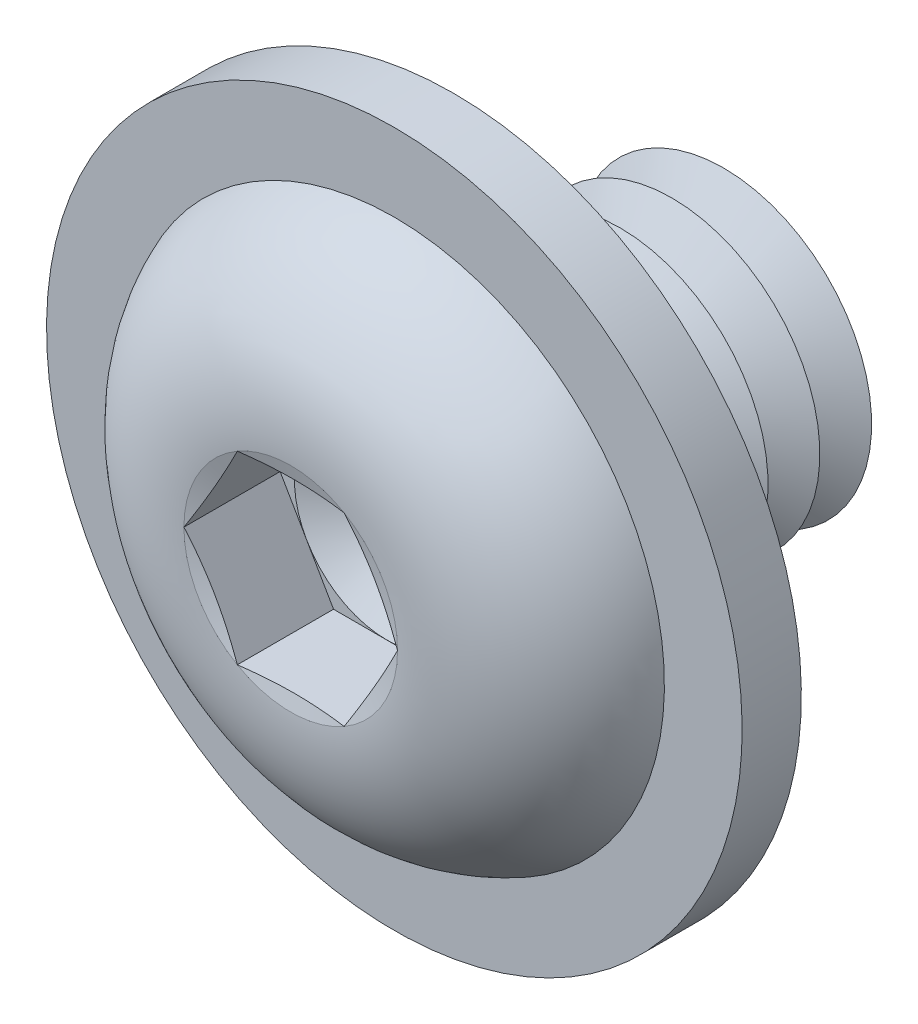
ISO-10303-21;
HEADER;
FILE_DESCRIPTION(('STEP AP214'),'2;1');
FILE_NAME('part.step','',(''),(''),'','','');
FILE_SCHEMA(('AUTOMOTIVE_DESIGN { 1 0 10303 214 1 1 1 1 }'));
ENDSEC;
DATA;
#1=APPLICATION_CONTEXT('core data for automotive mechanical design processes');
#2=APPLICATION_PROTOCOL_DEFINITION('international standard','automotive_design',2000,#1);
#3=PRODUCT_CONTEXT('',#1,'mechanical');
#4=PRODUCT('Part','Part','',(#3));
#5=PRODUCT_RELATED_PRODUCT_CATEGORY('part','',(#4));
#6=PRODUCT_DEFINITION_FORMATION('','',#4);
#7=PRODUCT_DEFINITION_CONTEXT('part definition',#1,'design');
#8=PRODUCT_DEFINITION('design','',#6,#7);
#9=PRODUCT_DEFINITION_SHAPE('','',#8);
#10=(LENGTH_UNIT() NAMED_UNIT(*) SI_UNIT(.MILLI.,.METRE.));
#11=(NAMED_UNIT(*) PLANE_ANGLE_UNIT() SI_UNIT($,.RADIAN.));
#12=(NAMED_UNIT(*) SI_UNIT($,.STERADIAN.) SOLID_ANGLE_UNIT());
#13=UNCERTAINTY_MEASURE_WITH_UNIT(LENGTH_MEASURE(1.E-05),#10,'distance_accuracy_value','');
#14=(GEOMETRIC_REPRESENTATION_CONTEXT(3) GLOBAL_UNCERTAINTY_ASSIGNED_CONTEXT((#13)) GLOBAL_UNIT_ASSIGNED_CONTEXT((#10,
#11,#12)) REPRESENTATION_CONTEXT('',''));
#15=CARTESIAN_POINT('',(0.,0.,0.));
#16=DIRECTION('',(0.,0.,1.));
#17=DIRECTION('',(1.,0.,0.));
#18=AXIS2_PLACEMENT_3D('',#15,#16,#17);
#19=CARTESIAN_POINT('',(0.,0.,-1.55));
#20=DIRECTION('',(0.,0.,1.));
#21=DIRECTION('',(0.,-1.,0.));
#22=AXIS2_PLACEMENT_3D('',#19,#20,#21);
#23=CONICAL_SURFACE('',#22,2.,1.04719755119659);
#24=CARTESIAN_POINT('',(0.,0.,-1.9));
#25=DIRECTION('',(0.,0.,1.));
#26=DIRECTION('',(0.,-1.,0.));
#27=AXIS2_PLACEMENT_3D('',#24,#25,#26);
#28=CIRCLE('',#27,1.39378221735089);
#29=CARTESIAN_POINT('',(0.,-1.39378221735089,-1.90000000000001));
#30=VERTEX_POINT('',#29);
#31=EDGE_CURVE('E249',#30,#30,#28,.T.);
#32=ORIENTED_EDGE('',*,*,#31,.T.);
#33=EDGE_LOOP('',(#32));
#34=FACE_BOUND('',#33,.T.);
#35=CARTESIAN_POINT('',(0.,0.,-1.55));
#36=DIRECTION('',(0.,0.,1.));
#37=DIRECTION('',(0.,-1.,0.));
#38=AXIS2_PLACEMENT_3D('',#35,#36,#37);
#39=CIRCLE('',#38,2.);
#40=CARTESIAN_POINT('',(0.,-2.,-1.55));
#41=VERTEX_POINT('',#40);
#42=EDGE_CURVE('E241',#41,#41,#39,.T.);
#43=ORIENTED_EDGE('',*,*,#42,.F.);
#44=EDGE_LOOP('',(#43));
#45=FACE_BOUND('',#44,.T.);
#46=ADVANCED_FACE('F39',(#34,#45),#23,.T.);
#47=CARTESIAN_POINT('',(0.,0.,-1.9));
#48=DIRECTION('',(0.,0.,-1.));
#49=DIRECTION('',(0.,1.,0.));
#50=AXIS2_PLACEMENT_3D('',#47,#48,#49);
#51=CONICAL_SURFACE('',#50,1.39378221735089,1.0471975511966);
#52=CARTESIAN_POINT('',(0.,0.,-2.25));
#53=DIRECTION('',(0.,0.,1.));
#54=DIRECTION('',(0.,-1.,0.));
#55=AXIS2_PLACEMENT_3D('',#52,#53,#54);
#56=CIRCLE('',#55,2.);
#57=CARTESIAN_POINT('',(0.,-2.,-2.25));
#58=VERTEX_POINT('',#57);
#59=EDGE_CURVE('E253',#58,#58,#56,.T.);
#60=ORIENTED_EDGE('',*,*,#59,.T.);
#61=EDGE_LOOP('',(#60));
#62=FACE_BOUND('',#61,.T.);
#63=ORIENTED_EDGE('',*,*,#31,.F.);
#64=EDGE_LOOP('',(#63));
#65=FACE_BOUND('',#64,.T.);
#66=ADVANCED_FACE('F373',(#62,#65),#51,.T.);
#67=CARTESIAN_POINT('',(0.,1.99999999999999,-4.));
#68=DIRECTION('',(0.,0.,-1.));
#69=DIRECTION('',(0.,1.,0.));
#70=AXIS2_PLACEMENT_3D('',#67,#68,#69);
#71=PLANE('',#70);
#72=CARTESIAN_POINT('',(0.,0.,-4.));
#73=DIRECTION('',(0.,0.,1.));
#74=DIRECTION('',(0.,-1.,0.));
#75=AXIS2_PLACEMENT_3D('',#72,#73,#74);
#76=CIRCLE('',#75,1.39378221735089);
#77=CARTESIAN_POINT('',(0.,-1.39378221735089,-4.00000000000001));
#78=VERTEX_POINT('',#77);
#79=EDGE_CURVE('E273',#78,#78,#76,.T.);
#80=ORIENTED_EDGE('',*,*,#79,.F.);
#81=EDGE_LOOP('',(#80));
#82=FACE_BOUND('',#81,.T.);
#83=ADVANCED_FACE('F379',(#82),#71,.T.);
#84=CARTESIAN_POINT('',(0.,0.,-3.65));
#85=DIRECTION('',(0.,0.,1.));
#86=DIRECTION('',(0.,-1.,0.));
#87=AXIS2_PLACEMENT_3D('',#84,#85,#86);
#88=CONICAL_SURFACE('',#87,2.,1.04719755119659);
#89=ORIENTED_EDGE('',*,*,#79,.T.);
#90=EDGE_LOOP('',(#89));
#91=FACE_BOUND('',#90,.T.);
#92=CARTESIAN_POINT('',(0.,0.,-3.65));
#93=DIRECTION('',(0.,0.,1.));
#94=DIRECTION('',(0.,-1.,0.));
#95=AXIS2_PLACEMENT_3D('',#92,#93,#94);
#96=CIRCLE('',#95,2.);
#97=CARTESIAN_POINT('',(0.,-2.,-3.65));
#98=VERTEX_POINT('',#97);
#99=EDGE_CURVE('E269',#98,#98,#96,.T.);
#100=ORIENTED_EDGE('',*,*,#99,.F.);
#101=EDGE_LOOP('',(#100));
#102=FACE_BOUND('',#101,.T.);
#103=ADVANCED_FACE('F397',(#91,#102),#88,.T.);
#104=CARTESIAN_POINT('',(0.,0.,-3.3));
#105=DIRECTION('',(0.,0.,-1.));
#106=DIRECTION('',(0.,1.,0.));
#107=AXIS2_PLACEMENT_3D('',#104,#105,#106);
#108=CONICAL_SURFACE('',#107,1.39378221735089,1.0471975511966);
#109=ORIENTED_EDGE('',*,*,#99,.T.);
#110=EDGE_LOOP('',(#109));
#111=FACE_BOUND('',#110,.T.);
#112=CARTESIAN_POINT('',(0.,0.,-3.3));
#113=DIRECTION('',(0.,0.,1.));
#114=DIRECTION('',(0.,-1.,0.));
#115=AXIS2_PLACEMENT_3D('',#112,#113,#114);
#116=CIRCLE('',#115,1.39378221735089);
#117=CARTESIAN_POINT('',(0.,-1.39378221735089,-3.30000000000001));
#118=VERTEX_POINT('',#117);
#119=EDGE_CURVE('E265',#118,#118,#116,.T.);
#120=ORIENTED_EDGE('',*,*,#119,.F.);
#121=EDGE_LOOP('',(#120));
#122=FACE_BOUND('',#121,.T.);
#123=ADVANCED_FACE('F394',(#111,#122),#108,.T.);
#124=CARTESIAN_POINT('',(0.,0.,-2.95));
#125=DIRECTION('',(0.,0.,1.));
#126=DIRECTION('',(0.,-1.,0.));
#127=AXIS2_PLACEMENT_3D('',#124,#125,#126);
#128=CONICAL_SURFACE('',#127,2.,1.04719755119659);
#129=ORIENTED_EDGE('',*,*,#119,.T.);
#130=EDGE_LOOP('',(#129));
#131=FACE_BOUND('',#130,.T.);
#132=CARTESIAN_POINT('',(0.,0.,-2.95));
#133=DIRECTION('',(0.,0.,1.));
#134=DIRECTION('',(0.,-1.,0.));
#135=AXIS2_PLACEMENT_3D('',#132,#133,#134);
#136=CIRCLE('',#135,2.);
#137=CARTESIAN_POINT('',(0.,-2.,-2.95));
#138=VERTEX_POINT('',#137);
#139=EDGE_CURVE('E261',#138,#138,#136,.T.);
#140=ORIENTED_EDGE('',*,*,#139,.F.);
#141=EDGE_LOOP('',(#140));
#142=FACE_BOUND('',#141,.T.);
#143=ADVANCED_FACE('F388',(#131,#142),#128,.T.);
#144=CARTESIAN_POINT('',(0.,0.,-2.6));
#145=DIRECTION('',(0.,0.,-1.));
#146=DIRECTION('',(0.,1.,0.));
#147=AXIS2_PLACEMENT_3D('',#144,#145,#146);
#148=CONICAL_SURFACE('',#147,1.39378221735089,1.0471975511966);
#149=ORIENTED_EDGE('',*,*,#139,.T.);
#150=EDGE_LOOP('',(#149));
#151=FACE_BOUND('',#150,.T.);
#152=CARTESIAN_POINT('',(0.,0.,-2.6));
#153=DIRECTION('',(0.,0.,1.));
#154=DIRECTION('',(0.,-1.,0.));
#155=AXIS2_PLACEMENT_3D('',#152,#153,#154);
#156=CIRCLE('',#155,1.39378221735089);
#157=CARTESIAN_POINT('',(0.,-1.39378221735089,-2.6));
#158=VERTEX_POINT('',#157);
#159=EDGE_CURVE('E257',#158,#158,#156,.T.);
#160=ORIENTED_EDGE('',*,*,#159,.F.);
#161=EDGE_LOOP('',(#160));
#162=FACE_BOUND('',#161,.T.);
#163=ADVANCED_FACE('F384',(#151,#162),#148,.T.);
#164=CARTESIAN_POINT('',(0.,0.,-2.25));
#165=DIRECTION('',(0.,0.,1.));
#166=DIRECTION('',(0.,-1.,0.));
#167=AXIS2_PLACEMENT_3D('',#164,#165,#166);
#168=CONICAL_SURFACE('',#167,2.,1.04719755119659);
#169=ORIENTED_EDGE('',*,*,#159,.T.);
#170=EDGE_LOOP('',(#169));
#171=FACE_BOUND('',#170,.T.);
#172=ORIENTED_EDGE('',*,*,#59,.F.);
#173=EDGE_LOOP('',(#172));
#174=FACE_BOUND('',#173,.T.);
#175=ADVANCED_FACE('F387',(#171,#174),#168,.T.);
#176=CARTESIAN_POINT('',(0.,0.,-0.850000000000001));
#177=DIRECTION('',(0.,0.,1.));
#178=DIRECTION('',(0.,-1.,0.));
#179=AXIS2_PLACEMENT_3D('',#176,#177,#178);
#180=CONICAL_SURFACE('',#179,2.,1.04719755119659);
#181=CARTESIAN_POINT('',(0.,0.,-1.2));
#182=DIRECTION('',(0.,0.,1.));
#183=DIRECTION('',(0.,-1.,0.));
#184=AXIS2_PLACEMENT_3D('',#181,#182,#183);
#185=CIRCLE('',#184,1.39378221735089);
#186=CARTESIAN_POINT('',(0.,-1.39378221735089,-1.20000000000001));
#187=VERTEX_POINT('',#186);
#188=EDGE_CURVE('E230',#187,#187,#185,.T.);
#189=ORIENTED_EDGE('',*,*,#188,.T.);
#190=EDGE_LOOP('',(#189));
#191=FACE_BOUND('',#190,.T.);
#192=CARTESIAN_POINT('',(0.,0.,-0.850000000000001));
#193=DIRECTION('',(0.,0.,1.));
#194=DIRECTION('',(0.,-1.,0.));
#195=AXIS2_PLACEMENT_3D('',#192,#193,#194);
#196=CIRCLE('',#195,2.);
#197=CARTESIAN_POINT('',(0.,-2.,-0.850000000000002));
#198=VERTEX_POINT('',#197);
#199=EDGE_CURVE('E245',#198,#198,#196,.T.);
#200=ORIENTED_EDGE('',*,*,#199,.F.);
#201=EDGE_LOOP('',(#200));
#202=FACE_BOUND('',#201,.T.);
#203=ADVANCED_FACE('F392',(#191,#202),#180,.T.);
#204=CARTESIAN_POINT('',(0.,0.,-1.2));
#205=DIRECTION('',(0.,0.,-1.));
#206=DIRECTION('',(0.,1.,0.));
#207=AXIS2_PLACEMENT_3D('',#204,#205,#206);
#208=CONICAL_SURFACE('',#207,1.39378221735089,1.0471975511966);
#209=ORIENTED_EDGE('',*,*,#42,.T.);
#210=EDGE_LOOP('',(#209));
#211=FACE_BOUND('',#210,.T.);
#212=ORIENTED_EDGE('',*,*,#188,.F.);
#213=EDGE_LOOP('',(#212));
#214=FACE_BOUND('',#213,.T.);
#215=ADVANCED_FACE('F219',(#211,#214),#208,.T.);
#216=CARTESIAN_POINT('',(0.,1.99999999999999,0.));
#217=DIRECTION('',(0.,0.,-1.));
#218=DIRECTION('',(0.,1.,0.));
#219=AXIS2_PLACEMENT_3D('',#216,#217,#218);
#220=PLANE('',#219);
#221=CARTESIAN_POINT('',(0.,0.,0.));
#222=DIRECTION('',(0.,0.,-1.));
#223=DIRECTION('',(0.,1.,0.));
#224=AXIS2_PLACEMENT_3D('',#221,#222,#223);
#225=CIRCLE('',#224,2.35);
#226=CARTESIAN_POINT('',(0.,2.34999999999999,0.));
#227=VERTEX_POINT('',#226);
#228=EDGE_CURVE('E287',#227,#227,#225,.F.);
#229=ORIENTED_EDGE('',*,*,#228,.T.);
#230=EDGE_LOOP('',(#229));
#231=FACE_BOUND('',#230,.T.);
#232=CARTESIAN_POINT('',(0.,0.,0.));
#233=DIRECTION('',(0.,0.,-1.));
#234=DIRECTION('',(0.,1.,0.));
#235=AXIS2_PLACEMENT_3D('',#232,#233,#234);
#236=CIRCLE('',#235,4.7);
#237=CARTESIAN_POINT('',(0.,4.7,0.));
#238=VERTEX_POINT('',#237);
#239=EDGE_CURVE('E711',#238,#238,#236,.T.);
#240=ORIENTED_EDGE('',*,*,#239,.T.);
#241=EDGE_LOOP('',(#240));
#242=FACE_BOUND('',#241,.T.);
#243=ADVANCED_FACE('F448',(#231,#242),#220,.T.);
#244=CARTESIAN_POINT('',(0.,0.,-0.350000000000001));
#245=DIRECTION('',(0.,0.,-1.));
#246=DIRECTION('',(0.,1.,0.));
#247=AXIS2_PLACEMENT_3D('',#244,#245,#246);
#248=TOROIDAL_SURFACE('',#247,2.35,0.35);
#249=ORIENTED_EDGE('',*,*,#228,.F.);
#250=EDGE_LOOP('',(#249));
#251=FACE_BOUND('',#250,.T.);
#252=CARTESIAN_POINT('',(0.,0.,-0.350000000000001));
#253=DIRECTION('',(0.,0.,-1.));
#254=DIRECTION('',(0.,1.,0.));
#255=AXIS2_PLACEMENT_3D('',#252,#253,#254);
#256=CIRCLE('',#255,2.);
#257=CARTESIAN_POINT('',(0.,1.99999999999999,-0.35));
#258=VERTEX_POINT('',#257);
#259=EDGE_CURVE('E282',#258,#258,#256,.T.);
#260=ORIENTED_EDGE('',*,*,#259,.F.);
#261=EDGE_LOOP('',(#260));
#262=FACE_BOUND('',#261,.T.);
#263=ADVANCED_FACE('F41',(#251,#262),#248,.F.);
#264=CARTESIAN_POINT('',(0.,0.,-4.));
#265=DIRECTION('',(0.,0.,-1.));
#266=DIRECTION('',(0.,1.,0.));
#267=AXIS2_PLACEMENT_3D('',#264,#265,#266);
#268=CYLINDRICAL_SURFACE('',#267,2.);
#269=ORIENTED_EDGE('',*,*,#259,.T.);
#270=EDGE_LOOP('',(#269));
#271=FACE_BOUND('',#270,.T.);
#272=ORIENTED_EDGE('',*,*,#199,.T.);
#273=EDGE_LOOP('',(#272));
#274=FACE_BOUND('',#273,.T.);
#275=ADVANCED_FACE('F460',(#271,#274),#268,.T.);
#276=CARTESIAN_POINT('',(0.,0.,0.8));
#277=DIRECTION('',(0.,0.,-1.));
#278=DIRECTION('',(0.,1.,0.));
#279=AXIS2_PLACEMENT_3D('',#276,#277,#278);
#280=CYLINDRICAL_SURFACE('',#279,4.7);
#281=CARTESIAN_POINT('',(0.,0.,0.8));
#282=DIRECTION('',(0.,0.,-1.));
#283=DIRECTION('',(0.,1.,0.));
#284=AXIS2_PLACEMENT_3D('',#281,#282,#283);
#285=CIRCLE('',#284,4.7);
#286=CARTESIAN_POINT('',(0.,4.7,0.8));
#287=VERTEX_POINT('',#286);
#288=EDGE_CURVE('E709',#287,#287,#285,.T.);
#289=ORIENTED_EDGE('',*,*,#288,.T.);
#290=EDGE_LOOP('',(#289));
#291=FACE_BOUND('',#290,.T.);
#292=ORIENTED_EDGE('',*,*,#239,.F.);
#293=EDGE_LOOP('',(#292));
#294=FACE_BOUND('',#293,.T.);
#295=ADVANCED_FACE('F466',(#291,#294),#280,.T.);
#296=CARTESIAN_POINT('',(0.,0.,0.8));
#297=DIRECTION('',(0.,0.,-1.));
#298=DIRECTION('',(0.,1.,0.));
#299=AXIS2_PLACEMENT_3D('',#296,#297,#298);
#300=PLANE('',#299);
#301=CARTESIAN_POINT('',(0.,0.,0.8));
#302=DIRECTION('',(0.,0.,-1.));
#303=DIRECTION('',(0.,1.,0.));
#304=AXIS2_PLACEMENT_3D('',#301,#302,#303);
#305=CIRCLE('',#304,3.64977164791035);
#306=CARTESIAN_POINT('',(0.,3.64977164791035,0.8));
#307=VERTEX_POINT('',#306);
#308=EDGE_CURVE('E43',#307,#307,#305,.F.);
#309=ORIENTED_EDGE('',*,*,#308,.F.);
#310=EDGE_LOOP('',(#309));
#311=FACE_BOUND('',#310,.T.);
#312=ORIENTED_EDGE('',*,*,#288,.F.);
#313=EDGE_LOOP('',(#312));
#314=FACE_BOUND('',#313,.T.);
#315=ADVANCED_FACE('F117',(#311,#314),#300,.F.);
#316=CARTESIAN_POINT('',(0.,0.,0.9));
#317=DIRECTION('',(0.,0.,1.));
#318=DIRECTION('',(1.,0.,0.));
#319=AXIS2_PLACEMENT_3D('',#316,#317,#318);
#320=CONICAL_SURFACE('',#319,1.24999941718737,1.0471975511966);
#321=CARTESIAN_POINT('',(0.,0.,0.178312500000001));
#322=VERTEX_POINT('',#321);
#323=VERTEX_LOOP('',#322);
#324=FACE_BOUND('',#323,.T.);
#325=CARTESIAN_POINT('',(0.,0.,0.9));
#326=DIRECTION('',(0.,0.,1.));
#327=DIRECTION('',(1.,0.,0.));
#328=AXIS2_PLACEMENT_3D('',#325,#326,#327);
#329=CIRCLE('',#328,1.24999941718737);
#330=CARTESIAN_POINT('',(1.08253125,0.624999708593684,0.9));
#331=VERTEX_POINT('',#330);
#332=CARTESIAN_POINT('',(0.,1.24999941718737,0.9));
#333=VERTEX_POINT('',#332);
#334=EDGE_CURVE('E120',#331,#333,#329,.T.);
#335=ORIENTED_EDGE('',*,*,#334,.T.);
#336=CARTESIAN_POINT('',(0.,0.,0.9));
#337=DIRECTION('',(0.,0.,1.));
#338=DIRECTION('',(1.,0.,0.));
#339=AXIS2_PLACEMENT_3D('',#336,#337,#338);
#340=CIRCLE('',#339,1.24999941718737);
#341=CARTESIAN_POINT('',(-1.08253125,0.624999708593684,0.9));
#342=VERTEX_POINT('',#341);
#343=EDGE_CURVE('E11',#333,#342,#340,.T.);
#344=ORIENTED_EDGE('',*,*,#343,.T.);
#345=CARTESIAN_POINT('',(-1.08253125,-0.624999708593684,0.9));
#346=VERTEX_POINT('',#345);
#347=EDGE_CURVE('E49',#342,#346,#340,.T.);
#348=ORIENTED_EDGE('',*,*,#347,.T.);
#349=CARTESIAN_POINT('',(0.,-1.24999941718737,0.9));
#350=VERTEX_POINT('',#349);
#351=EDGE_CURVE('E292',#346,#350,#340,.T.);
#352=ORIENTED_EDGE('',*,*,#351,.T.);
#353=CARTESIAN_POINT('',(1.08253125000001,-0.624999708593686,0.9));
#354=VERTEX_POINT('',#353);
#355=EDGE_CURVE('E57',#350,#354,#340,.T.);
#356=ORIENTED_EDGE('',*,*,#355,.T.);
#357=EDGE_CURVE('E50',#354,#331,#340,.T.);
#358=ORIENTED_EDGE('',*,*,#357,.T.);
#359=EDGE_LOOP('',(#335,#344,#348,#352,#356,#358));
#360=FACE_BOUND('',#359,.T.);
#361=ADVANCED_FACE('F114',(#324,#360),#320,.F.);
#362=CARTESIAN_POINT('',(0.,0.,0.9));
#363=DIRECTION('',(0.,0.,1.));
#364=DIRECTION('',(1.,0.,0.));
#365=AXIS2_PLACEMENT_3D('',#362,#363,#364);
#366=PLANE('',#365);
#367=ORIENTED_EDGE('',*,*,#343,.F.);
#368=DIRECTION('',(-1.,0.,0.));
#369=VECTOR('',#368,1.);
#370=CARTESIAN_POINT('',(0.721687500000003,1.24999941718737,0.9));
#371=LINE('',#370,#369);
#372=CARTESIAN_POINT('',(-0.721687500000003,1.24999941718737,0.9));
#373=VERTEX_POINT('',#372);
#374=EDGE_CURVE('E132',#333,#373,#371,.T.);
#375=ORIENTED_EDGE('',*,*,#374,.T.);
#376=DIRECTION('',(-0.5,-0.866025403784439,0.));
#377=VECTOR('',#376,1.);
#378=CARTESIAN_POINT('',(-0.721687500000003,1.24999941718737,0.9));
#379=LINE('',#378,#377);
#380=EDGE_CURVE('E135',#373,#342,#379,.T.);
#381=ORIENTED_EDGE('',*,*,#380,.T.);
#382=EDGE_LOOP('',(#367,#375,#381));
#383=FACE_BOUND('',#382,.T.);
#384=ADVANCED_FACE('F116',(#383),#366,.T.);
#385=ORIENTED_EDGE('',*,*,#347,.F.);
#386=CARTESIAN_POINT('',(-1.44337500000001,0.,0.9));
#387=VERTEX_POINT('',#386);
#388=EDGE_CURVE('E145',#342,#387,#379,.T.);
#389=ORIENTED_EDGE('',*,*,#388,.T.);
#390=DIRECTION('',(0.5,-0.866025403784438,0.));
#391=VECTOR('',#390,1.);
#392=CARTESIAN_POINT('',(-1.44337500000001,0.,0.9));
#393=LINE('',#392,#391);
#394=EDGE_CURVE('E154',#387,#346,#393,.T.);
#395=ORIENTED_EDGE('',*,*,#394,.T.);
#396=EDGE_LOOP('',(#385,#389,#395));
#397=FACE_BOUND('',#396,.T.);
#398=ADVANCED_FACE('F309',(#397),#366,.T.);
#399=ORIENTED_EDGE('',*,*,#351,.F.);
#400=CARTESIAN_POINT('',(-0.721687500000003,-1.24999941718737,0.9));
#401=VERTEX_POINT('',#400);
#402=EDGE_CURVE('E153',#346,#401,#393,.T.);
#403=ORIENTED_EDGE('',*,*,#402,.T.);
#404=DIRECTION('',(1.,0.,0.));
#405=VECTOR('',#404,1.);
#406=CARTESIAN_POINT('',(-0.721687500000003,-1.24999941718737,0.9));
#407=LINE('',#406,#405);
#408=EDGE_CURVE('E158',#401,#350,#407,.T.);
#409=ORIENTED_EDGE('',*,*,#408,.T.);
#410=EDGE_LOOP('',(#399,#403,#409));
#411=FACE_BOUND('',#410,.T.);
#412=ADVANCED_FACE('F302',(#411),#366,.T.);
#413=ORIENTED_EDGE('',*,*,#355,.F.);
#414=CARTESIAN_POINT('',(0.721687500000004,-1.24999941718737,0.9));
#415=VERTEX_POINT('',#414);
#416=EDGE_CURVE('E157',#350,#415,#407,.T.);
#417=ORIENTED_EDGE('',*,*,#416,.T.);
#418=DIRECTION('',(0.5,0.866025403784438,0.));
#419=VECTOR('',#418,1.);
#420=CARTESIAN_POINT('',(0.721687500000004,-1.24999941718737,0.9));
#421=LINE('',#420,#419);
#422=EDGE_CURVE('E163',#415,#354,#421,.T.);
#423=ORIENTED_EDGE('',*,*,#422,.T.);
#424=EDGE_LOOP('',(#413,#417,#423));
#425=FACE_BOUND('',#424,.T.);
#426=ADVANCED_FACE('F495',(#425),#366,.T.);
#427=ORIENTED_EDGE('',*,*,#357,.F.);
#428=CARTESIAN_POINT('',(1.44337500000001,0.,0.9));
#429=VERTEX_POINT('',#428);
#430=EDGE_CURVE('E162',#354,#429,#421,.T.);
#431=ORIENTED_EDGE('',*,*,#430,.T.);
#432=DIRECTION('',(-0.5,0.866025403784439,0.));
#433=VECTOR('',#432,1.);
#434=CARTESIAN_POINT('',(1.44337500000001,0.,0.9));
#435=LINE('',#434,#433);
#436=EDGE_CURVE('E141',#429,#331,#435,.T.);
#437=ORIENTED_EDGE('',*,*,#436,.T.);
#438=EDGE_LOOP('',(#427,#431,#437));
#439=FACE_BOUND('',#438,.T.);
#440=ADVANCED_FACE('F500',(#439),#366,.T.);
#441=ORIENTED_EDGE('',*,*,#334,.F.);
#442=CARTESIAN_POINT('',(0.721687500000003,1.24999941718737,0.9));
#443=VERTEX_POINT('',#442);
#444=EDGE_CURVE('E127',#331,#443,#435,.T.);
#445=ORIENTED_EDGE('',*,*,#444,.T.);
#446=EDGE_CURVE('E137',#443,#333,#371,.T.);
#447=ORIENTED_EDGE('',*,*,#446,.T.);
#448=EDGE_LOOP('',(#441,#445,#447));
#449=FACE_BOUND('',#448,.T.);
#450=ADVANCED_FACE('F143',(#449),#366,.T.);
#451=CARTESIAN_POINT('',(0.721687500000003,1.24999941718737,0.9));
#452=DIRECTION('',(0.,1.,0.));
#453=DIRECTION('',(-1.,0.,0.));
#454=AXIS2_PLACEMENT_3D('',#451,#452,#453);
#455=PLANE('',#454);
#456=CARTESIAN_POINT('',(2.17815859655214,1.24999941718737,2.48616275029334));
#457=CARTESIAN_POINT('',(2.07269794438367,1.24999941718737,2.4616881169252));
#458=CARTESIAN_POINT('',(1.967149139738,1.24999941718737,2.43756889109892));
#459=CARTESIAN_POINT('',(1.75576352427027,1.24999941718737,2.39052699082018));
#460=CARTESIAN_POINT('',(1.64992665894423,1.24999941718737,2.36760456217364));
#461=CARTESIAN_POINT('',(1.43690237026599,1.24999941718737,2.3232454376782));
#462=CARTESIAN_POINT('',(1.32971158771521,1.24999941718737,2.30182468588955));
#463=CARTESIAN_POINT('',(1.1148274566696,1.24999941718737,2.26156703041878));
#464=CARTESIAN_POINT('',(1.00713406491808,1.24999941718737,2.24273035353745));
#465=CARTESIAN_POINT('',(0.794044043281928,1.24999941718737,2.2093913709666));
#466=CARTESIAN_POINT('',(0.688664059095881,1.24999941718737,2.19478562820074));
#467=CARTESIAN_POINT('',(0.477310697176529,1.24999941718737,2.17085809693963));
#468=CARTESIAN_POINT('',(0.371337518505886,1.24999941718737,2.16153463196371));
#469=CARTESIAN_POINT('',(0.159455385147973,1.24999941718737,2.14976770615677));
#470=CARTESIAN_POINT('',(0.0535482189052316,1.24999941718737,2.14729400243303));
#471=CARTESIAN_POINT('',(-0.158189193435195,1.24999941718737,2.14966287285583));
#472=CARTESIAN_POINT('',(-0.264019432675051,1.24999941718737,2.15450603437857));
#473=CARTESIAN_POINT('',(-0.445148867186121,1.24999941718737,2.16825380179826));
#474=CARTESIAN_POINT('',(-0.52057478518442,1.24999941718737,2.17561242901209));
#475=CARTESIAN_POINT('',(-0.671115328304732,1.24999941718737,2.19297000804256));
#476=CARTESIAN_POINT('',(-0.746229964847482,1.24999941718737,2.20296886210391));
#477=CARTESIAN_POINT('',(-0.896387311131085,1.24999941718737,2.22505910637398));
#478=CARTESIAN_POINT('',(-0.971429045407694,1.24999941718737,2.23715700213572));
#479=CARTESIAN_POINT('',(-1.12124320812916,1.24999941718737,2.26292371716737));
#480=CARTESIAN_POINT('',(-1.19601562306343,1.24999941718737,2.27659261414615));
#481=CARTESIAN_POINT('',(-1.34686913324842,1.24999941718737,2.30540811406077));
#482=CARTESIAN_POINT('',(-1.42294548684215,1.24999941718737,2.32057934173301));
#483=CARTESIAN_POINT('',(-1.57490676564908,1.24999941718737,2.35185113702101));
#484=CARTESIAN_POINT('',(-1.65079168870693,1.24999941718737,2.36795171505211));
#485=CARTESIAN_POINT('',(-1.80199501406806,1.24999941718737,2.40076814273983));
#486=CARTESIAN_POINT('',(-1.8773142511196,1.24999941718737,2.41748016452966));
#487=CARTESIAN_POINT('',(-2.02782424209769,1.24999941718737,2.45144971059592));
#488=CARTESIAN_POINT('',(-2.10301500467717,1.24999941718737,2.46870719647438));
#489=CARTESIAN_POINT('',(-2.17815859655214,1.24999941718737,2.48616275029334));
#490=B_SPLINE_CURVE_WITH_KNOTS('',3,(#456,#457,#458,#459,#460,#461,#462,#463,#464,#465,#466,
#467,#468,#469,#470,#471,#472,#473,#474,#475,#476,#477,#478,#479,#480,#481,#482,#483,#484,#485,
#486,#487,#488,#489),.UNSPECIFIED.,.F.,.F.,(4,2,2,2,2,2,2,2,2,2,2,2,2,2,2,2,4),(0.,
0.324797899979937,0.64966224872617,0.977572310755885,1.30551113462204,1.62458166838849,
1.94355087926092,2.26110952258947,2.57869365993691,2.80599541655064,3.03328875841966,
3.26129956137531,3.48932164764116,3.72203713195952,3.95475522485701,4.18620606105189,
4.4176406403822),.UNSPECIFIED.);
#491=CARTESIAN_POINT('',(0.721687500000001,1.24999941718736,2.2));
#492=VERTEX_POINT('',#491);
#493=CARTESIAN_POINT('',(-0.721687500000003,1.24999941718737,2.2));
#494=VERTEX_POINT('',#493);
#495=EDGE_CURVE('E171',#492,#494,#490,.T.);
#496=ORIENTED_EDGE('',*,*,#495,.T.);
#497=DIRECTION('',(0.,0.,1.));
#498=VECTOR('',#497,1.);
#499=CARTESIAN_POINT('',(-0.721687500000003,1.24999941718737,0.9));
#500=LINE('',#499,#498);
#501=EDGE_CURVE('E139',#373,#494,#500,.T.);
#502=ORIENTED_EDGE('',*,*,#501,.F.);
#503=ORIENTED_EDGE('',*,*,#374,.F.);
#504=ORIENTED_EDGE('',*,*,#446,.F.);
#505=DIRECTION('',(0.,0.,1.));
#506=VECTOR('',#505,1.);
#507=CARTESIAN_POINT('',(0.721687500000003,1.24999941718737,0.9));
#508=LINE('',#507,#506);
#509=EDGE_CURVE('E65',#443,#492,#508,.T.);
#510=ORIENTED_EDGE('',*,*,#509,.T.);
#511=EDGE_LOOP('',(#496,#502,#503,#504,#510));
#512=FACE_BOUND('',#511,.T.);
#513=ADVANCED_FACE('F136',(#512),#455,.F.);
#514=CARTESIAN_POINT('',(-0.721687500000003,1.24999941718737,0.9));
#515=DIRECTION('',(-0.866025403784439,0.5,0.));
#516=DIRECTION('',(-0.5,-0.866025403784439,0.));
#517=AXIS2_PLACEMENT_3D('',#514,#515,#516);
#518=PLANE('',#517);
#519=CARTESIAN_POINT('',(-0.721572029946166,1.25019941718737,2.2000309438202));
#520=CARTESIAN_POINT('',(-0.751551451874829,1.19827353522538,2.19199301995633));
#521=CARTESIAN_POINT('',(-0.781585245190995,1.14625347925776,2.18469579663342));
#522=CARTESIAN_POINT('',(-0.841758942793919,1.04202957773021,2.17187512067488));
#523=CARTESIAN_POINT('',(-0.871898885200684,0.989825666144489,2.16635238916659));
#524=CARTESIAN_POINT('',(-0.932102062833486,0.885550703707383,2.15740323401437));
#525=CARTESIAN_POINT('',(-0.962164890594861,0.83348035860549,2.15396613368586));
#526=CARTESIAN_POINT('',(-1.02232890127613,0.72927323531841,2.14935732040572));
#527=CARTESIAN_POINT('',(-1.05243007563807,0.677136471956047,2.14818516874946));
#528=CARTESIAN_POINT('',(-1.11263242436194,0.57286294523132,2.14818516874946));
#529=CARTESIAN_POINT('',(-1.14273359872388,0.520726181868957,2.14935732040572));
#530=CARTESIAN_POINT('',(-1.20289760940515,0.416519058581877,2.15396613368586));
#531=CARTESIAN_POINT('',(-1.23296043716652,0.364448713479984,2.15740323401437));
#532=CARTESIAN_POINT('',(-1.29316361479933,0.260173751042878,2.16635238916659));
#533=CARTESIAN_POINT('',(-1.32330355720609,0.20796983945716,2.17187512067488));
#534=CARTESIAN_POINT('',(-1.38347725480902,0.103745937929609,2.18469579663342));
#535=CARTESIAN_POINT('',(-1.41351104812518,0.0517258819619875,2.19199301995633));
#536=CARTESIAN_POINT('',(-1.44349047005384,-0.000200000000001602,2.20003094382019));
#537=B_SPLINE_CURVE_WITH_KNOTS('',3,(#519,#520,#521,#522,#523,#524,#525,#526,#527,#528,#529,
#530,#531,#532,#533,#534,#535,#536),.UNSPECIFIED.,.F.,.F.,(4,2,2,2,2,2,2,2,4),(0.,
0.181495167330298,0.363063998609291,0.543695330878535,0.724291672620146,0.904888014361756,
1.085519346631,1.26708817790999,1.44858334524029),.UNSPECIFIED.);
#538=CARTESIAN_POINT('',(-1.44337500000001,0.,2.2));
#539=VERTEX_POINT('',#538);
#540=EDGE_CURVE('E196',#494,#539,#537,.T.);
#541=ORIENTED_EDGE('',*,*,#540,.T.);
#542=DIRECTION('',(0.,0.,1.));
#543=VECTOR('',#542,1.);
#544=CARTESIAN_POINT('',(-1.44337500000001,0.,0.9));
#545=LINE('',#544,#543);
#546=EDGE_CURVE('E180',#387,#539,#545,.T.);
#547=ORIENTED_EDGE('',*,*,#546,.F.);
#548=ORIENTED_EDGE('',*,*,#388,.F.);
#549=ORIENTED_EDGE('',*,*,#380,.F.);
#550=ORIENTED_EDGE('',*,*,#501,.T.);
#551=EDGE_LOOP('',(#541,#547,#548,#549,#550));
#552=FACE_BOUND('',#551,.T.);
#553=ADVANCED_FACE('F210',(#552),#518,.F.);
#554=CARTESIAN_POINT('',(-1.44337500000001,0.,0.9));
#555=DIRECTION('',(-0.866025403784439,-0.5,0.));
#556=DIRECTION('',(0.5,-0.866025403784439,0.));
#557=AXIS2_PLACEMENT_3D('',#554,#555,#556);
#558=PLANE('',#557);
#559=CARTESIAN_POINT('',(-1.44349047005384,0.000199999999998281,2.20003094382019));
#560=CARTESIAN_POINT('',(-1.41351104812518,-0.0517258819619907,2.19199301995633));
#561=CARTESIAN_POINT('',(-1.38347725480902,-0.103745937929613,2.18469579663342));
#562=CARTESIAN_POINT('',(-1.32330355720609,-0.207969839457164,2.17187512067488));
#563=CARTESIAN_POINT('',(-1.29316361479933,-0.260173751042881,2.16635238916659));
#564=CARTESIAN_POINT('',(-1.23296043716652,-0.364448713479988,2.15740323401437));
#565=CARTESIAN_POINT('',(-1.20289760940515,-0.41651905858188,2.15396613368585));
#566=CARTESIAN_POINT('',(-1.14273359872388,-0.52072618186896,2.14935732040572));
#567=CARTESIAN_POINT('',(-1.11263242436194,-0.572862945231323,2.14818516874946));
#568=CARTESIAN_POINT('',(-1.05243007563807,-0.67713647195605,2.14818516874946));
#569=CARTESIAN_POINT('',(-1.02232890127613,-0.729273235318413,2.14935732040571));
#570=CARTESIAN_POINT('',(-0.962164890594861,-0.833480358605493,2.15396613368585));
#571=CARTESIAN_POINT('',(-0.932102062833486,-0.885550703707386,2.15740323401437));
#572=CARTESIAN_POINT('',(-0.871898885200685,-0.989825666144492,2.16635238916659));
#573=CARTESIAN_POINT('',(-0.841758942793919,-1.04202957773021,2.17187512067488));
#574=CARTESIAN_POINT('',(-0.781585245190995,-1.14625347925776,2.18469579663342));
#575=CARTESIAN_POINT('',(-0.751551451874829,-1.19827353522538,2.19199301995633));
#576=CARTESIAN_POINT('',(-0.721572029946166,-1.25019941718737,2.20003094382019));
#577=B_SPLINE_CURVE_WITH_KNOTS('',3,(#559,#560,#561,#562,#563,#564,#565,#566,#567,#568,#569,
#570,#571,#572,#573,#574,#575,#576),.UNSPECIFIED.,.F.,.F.,(4,2,2,2,2,2,2,2,4),(0.,
0.181495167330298,0.363063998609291,0.543695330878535,0.724291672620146,0.904888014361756,
1.085519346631,1.26708817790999,1.44858334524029),.UNSPECIFIED.);
#578=CARTESIAN_POINT('',(-0.721687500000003,-1.24999941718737,2.2));
#579=VERTEX_POINT('',#578);
#580=EDGE_CURVE('E314',#539,#579,#577,.T.);
#581=ORIENTED_EDGE('',*,*,#580,.T.);
#582=DIRECTION('',(0.,0.,1.));
#583=VECTOR('',#582,1.);
#584=CARTESIAN_POINT('',(-0.721687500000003,-1.24999941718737,0.9));
#585=LINE('',#584,#583);
#586=EDGE_CURVE('E176',#401,#579,#585,.T.);
#587=ORIENTED_EDGE('',*,*,#586,.F.);
#588=ORIENTED_EDGE('',*,*,#402,.F.);
#589=ORIENTED_EDGE('',*,*,#394,.F.);
#590=ORIENTED_EDGE('',*,*,#546,.T.);
#591=EDGE_LOOP('',(#581,#587,#588,#589,#590));
#592=FACE_BOUND('',#591,.T.);
#593=ADVANCED_FACE('F307',(#592),#558,.F.);
#594=CARTESIAN_POINT('',(-0.721687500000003,-1.24999941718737,0.9));
#595=DIRECTION('',(0.,-1.,0.));
#596=DIRECTION('',(1.,0.,0.));
#597=AXIS2_PLACEMENT_3D('',#594,#595,#596);
#598=PLANE('',#597);
#599=CARTESIAN_POINT('',(-2.17815859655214,-1.24999941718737,2.48616275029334));
#600=CARTESIAN_POINT('',(-2.07269794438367,-1.24999941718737,2.4616881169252));
#601=CARTESIAN_POINT('',(-1.967149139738,-1.24999941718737,2.43756889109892));
#602=CARTESIAN_POINT('',(-1.75576352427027,-1.24999941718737,2.39052699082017));
#603=CARTESIAN_POINT('',(-1.64992665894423,-1.24999941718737,2.36760456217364));
#604=CARTESIAN_POINT('',(-1.43690237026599,-1.24999941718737,2.3232454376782));
#605=CARTESIAN_POINT('',(-1.32971158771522,-1.24999941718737,2.30182468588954));
#606=CARTESIAN_POINT('',(-1.1148274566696,-1.24999941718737,2.26156703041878));
#607=CARTESIAN_POINT('',(-1.00713406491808,-1.24999941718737,2.24273035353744));
#608=CARTESIAN_POINT('',(-0.794044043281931,-1.24999941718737,2.2093913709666));
#609=CARTESIAN_POINT('',(-0.688664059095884,-1.24999941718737,2.19478562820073));
#610=CARTESIAN_POINT('',(-0.477310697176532,-1.24999941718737,2.17085809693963));
#611=CARTESIAN_POINT('',(-0.37133751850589,-1.24999941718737,2.16153463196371));
#612=CARTESIAN_POINT('',(-0.159455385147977,-1.24999941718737,2.14976770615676));
#613=CARTESIAN_POINT('',(-0.0535482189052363,-1.24999941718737,2.14729400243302));
#614=CARTESIAN_POINT('',(0.15818919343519,-1.24999941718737,2.14966287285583));
#615=CARTESIAN_POINT('',(0.264019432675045,-1.24999941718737,2.15450603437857));
#616=CARTESIAN_POINT('',(0.445148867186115,-1.24999941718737,2.16825380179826));
#617=CARTESIAN_POINT('',(0.520574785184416,-1.24999941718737,2.17561242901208));
#618=CARTESIAN_POINT('',(0.671115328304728,-1.24999941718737,2.19297000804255));
#619=CARTESIAN_POINT('',(0.746229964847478,-1.24999941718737,2.20296886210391));
#620=CARTESIAN_POINT('',(0.896387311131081,-1.24999941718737,2.22505910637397));
#621=CARTESIAN_POINT('',(0.971429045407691,-1.24999941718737,2.23715700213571));
#622=CARTESIAN_POINT('',(1.12124320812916,-1.24999941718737,2.26292371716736));
#623=CARTESIAN_POINT('',(1.19601562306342,-1.24999941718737,2.27659261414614));
#624=CARTESIAN_POINT('',(1.34686913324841,-1.24999941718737,2.30540811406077));
#625=CARTESIAN_POINT('',(1.42294548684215,-1.24999941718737,2.32057934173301));
#626=CARTESIAN_POINT('',(1.57490676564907,-1.24999941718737,2.351851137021));
#627=CARTESIAN_POINT('',(1.65079168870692,-1.24999941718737,2.36795171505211));
#628=CARTESIAN_POINT('',(1.80199501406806,-1.24999941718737,2.40076814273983));
#629=CARTESIAN_POINT('',(1.8773142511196,-1.24999941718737,2.41748016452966));
#630=CARTESIAN_POINT('',(2.02782424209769,-1.24999941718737,2.45144971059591));
#631=CARTESIAN_POINT('',(2.10301500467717,-1.24999941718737,2.46870719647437));
#632=CARTESIAN_POINT('',(2.17815859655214,-1.24999941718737,2.48616275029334));
#633=B_SPLINE_CURVE_WITH_KNOTS('',3,(#599,#600,#601,#602,#603,#604,#605,#606,#607,#608,#609,
#610,#611,#612,#613,#614,#615,#616,#617,#618,#619,#620,#621,#622,#623,#624,#625,#626,#627,#628,
#629,#630,#631,#632),.UNSPECIFIED.,.F.,.F.,(4,2,2,2,2,2,2,2,2,2,2,2,2,2,2,2,4),(0.,
0.324797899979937,0.649662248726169,0.977572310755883,1.30551113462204,1.62458166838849,
1.94355087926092,2.26110952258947,2.5786936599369,2.80599541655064,3.03328875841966,
3.26129956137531,3.48932164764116,3.72203713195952,3.95475522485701,4.1862060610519,
4.4176406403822),.UNSPECIFIED.);
#634=CARTESIAN_POINT('',(0.721687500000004,-1.24999941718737,2.2));
#635=VERTEX_POINT('',#634);
#636=EDGE_CURVE('E323',#579,#635,#633,.T.);
#637=ORIENTED_EDGE('',*,*,#636,.T.);
#638=DIRECTION('',(0.,0.,1.));
#639=VECTOR('',#638,1.);
#640=CARTESIAN_POINT('',(0.721687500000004,-1.24999941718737,0.9));
#641=LINE('',#640,#639);
#642=EDGE_CURVE('E172',#415,#635,#641,.T.);
#643=ORIENTED_EDGE('',*,*,#642,.F.);
#644=ORIENTED_EDGE('',*,*,#416,.F.);
#645=ORIENTED_EDGE('',*,*,#408,.F.);
#646=ORIENTED_EDGE('',*,*,#586,.T.);
#647=EDGE_LOOP('',(#637,#643,#644,#645,#646));
#648=FACE_BOUND('',#647,.T.);
#649=ADVANCED_FACE('F362',(#648),#598,.F.);
#650=CARTESIAN_POINT('',(0.721687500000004,-1.24999941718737,0.9));
#651=DIRECTION('',(0.866025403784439,-0.5,0.));
#652=DIRECTION('',(0.5,0.866025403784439,0.));
#653=AXIS2_PLACEMENT_3D('',#650,#651,#652);
#654=PLANE('',#653);
#655=CARTESIAN_POINT('',(0.721572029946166,-1.25019941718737,2.20003094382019));
#656=CARTESIAN_POINT('',(0.751551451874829,-1.19827353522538,2.19199301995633));
#657=CARTESIAN_POINT('',(0.781585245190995,-1.14625347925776,2.18469579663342));
#658=CARTESIAN_POINT('',(0.84175894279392,-1.04202957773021,2.17187512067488));
#659=CARTESIAN_POINT('',(0.871898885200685,-0.989825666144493,2.16635238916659));
#660=CARTESIAN_POINT('',(0.932102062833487,-0.885550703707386,2.15740323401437));
#661=CARTESIAN_POINT('',(0.962164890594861,-0.833480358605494,2.15396613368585));
#662=CARTESIAN_POINT('',(1.02232890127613,-0.729273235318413,2.14935732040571));
#663=CARTESIAN_POINT('',(1.05243007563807,-0.67713647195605,2.14818516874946));
#664=CARTESIAN_POINT('',(1.11263242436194,-0.572862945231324,2.14818516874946));
#665=CARTESIAN_POINT('',(1.14273359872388,-0.52072618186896,2.14935732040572));
#666=CARTESIAN_POINT('',(1.20289760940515,-0.41651905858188,2.15396613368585));
#667=CARTESIAN_POINT('',(1.23296043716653,-0.364448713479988,2.15740323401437));
#668=CARTESIAN_POINT('',(1.29316361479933,-0.260173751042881,2.16635238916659));
#669=CARTESIAN_POINT('',(1.32330355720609,-0.207969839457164,2.17187512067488));
#670=CARTESIAN_POINT('',(1.38347725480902,-0.103745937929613,2.18469579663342));
#671=CARTESIAN_POINT('',(1.41351104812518,-0.0517258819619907,2.19199301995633));
#672=CARTESIAN_POINT('',(1.44349047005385,0.000199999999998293,2.20003094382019));
#673=B_SPLINE_CURVE_WITH_KNOTS('',3,(#655,#656,#657,#658,#659,#660,#661,#662,#663,#664,#665,
#666,#667,#668,#669,#670,#671,#672),.UNSPECIFIED.,.F.,.F.,(4,2,2,2,2,2,2,2,4),(0.,
0.181495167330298,0.363063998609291,0.543695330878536,0.724291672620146,0.904888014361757,
1.085519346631,1.26708817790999,1.44858334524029),.UNSPECIFIED.);
#674=CARTESIAN_POINT('',(1.44337500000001,0.,2.2));
#675=VERTEX_POINT('',#674);
#676=EDGE_CURVE('E231',#635,#675,#673,.T.);
#677=ORIENTED_EDGE('',*,*,#676,.T.);
#678=DIRECTION('',(0.,0.,1.));
#679=VECTOR('',#678,1.);
#680=CARTESIAN_POINT('',(1.44337500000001,0.,0.9));
#681=LINE('',#680,#679);
#682=EDGE_CURVE('E167',#429,#675,#681,.T.);
#683=ORIENTED_EDGE('',*,*,#682,.F.);
#684=ORIENTED_EDGE('',*,*,#430,.F.);
#685=ORIENTED_EDGE('',*,*,#422,.F.);
#686=ORIENTED_EDGE('',*,*,#642,.T.);
#687=EDGE_LOOP('',(#677,#683,#684,#685,#686));
#688=FACE_BOUND('',#687,.T.);
#689=ADVANCED_FACE('F217',(#688),#654,.F.);
#690=CARTESIAN_POINT('',(1.44337500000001,0.,0.9));
#691=DIRECTION('',(0.866025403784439,0.5,0.));
#692=DIRECTION('',(-0.5,0.866025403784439,0.));
#693=AXIS2_PLACEMENT_3D('',#690,#691,#692);
#694=PLANE('',#693);
#695=CARTESIAN_POINT('',(1.44349047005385,-0.00020000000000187,2.20003094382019));
#696=CARTESIAN_POINT('',(1.41351104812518,0.051725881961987,2.19199301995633));
#697=CARTESIAN_POINT('',(1.38347725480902,0.103745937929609,2.18469579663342));
#698=CARTESIAN_POINT('',(1.32330355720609,0.20796983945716,2.17187512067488));
#699=CARTESIAN_POINT('',(1.29316361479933,0.260173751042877,2.16635238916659));
#700=CARTESIAN_POINT('',(1.23296043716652,0.364448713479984,2.15740323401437));
#701=CARTESIAN_POINT('',(1.20289760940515,0.416519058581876,2.15396613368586));
#702=CARTESIAN_POINT('',(1.14273359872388,0.520726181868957,2.14935732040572));
#703=CARTESIAN_POINT('',(1.11263242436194,0.57286294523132,2.14818516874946));
#704=CARTESIAN_POINT('',(1.05243007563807,0.677136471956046,2.14818516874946));
#705=CARTESIAN_POINT('',(1.02232890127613,0.72927323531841,2.14935732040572));
#706=CARTESIAN_POINT('',(0.962164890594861,0.83348035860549,2.15396613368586));
#707=CARTESIAN_POINT('',(0.932102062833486,0.885550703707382,2.15740323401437));
#708=CARTESIAN_POINT('',(0.871898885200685,0.989825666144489,2.16635238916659));
#709=CARTESIAN_POINT('',(0.841758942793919,1.04202957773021,2.17187512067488));
#710=CARTESIAN_POINT('',(0.781585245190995,1.14625347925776,2.18469579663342));
#711=CARTESIAN_POINT('',(0.751551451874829,1.19827353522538,2.19199301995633));
#712=CARTESIAN_POINT('',(0.721572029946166,1.25019941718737,2.20003094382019));
#713=B_SPLINE_CURVE_WITH_KNOTS('',3,(#695,#696,#697,#698,#699,#700,#701,#702,#703,#704,#705,
#706,#707,#708,#709,#710,#711,#712),.UNSPECIFIED.,.F.,.F.,(4,2,2,2,2,2,2,2,4),(0.,
0.181495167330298,0.363063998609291,0.543695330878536,0.724291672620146,0.904888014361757,
1.085519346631,1.26708817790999,1.44858334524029),.UNSPECIFIED.);
#714=EDGE_CURVE('E222',#675,#492,#713,.T.);
#715=ORIENTED_EDGE('',*,*,#714,.T.);
#716=ORIENTED_EDGE('',*,*,#509,.F.);
#717=ORIENTED_EDGE('',*,*,#444,.F.);
#718=ORIENTED_EDGE('',*,*,#436,.F.);
#719=ORIENTED_EDGE('',*,*,#682,.T.);
#720=EDGE_LOOP('',(#715,#716,#717,#718,#719));
#721=FACE_BOUND('',#720,.T.);
#722=ADVANCED_FACE('F213',(#721),#694,.F.);
#723=CARTESIAN_POINT('',(0.,0.,2.2));
#724=DIRECTION('',(0.,0.,1.));
#725=DIRECTION('',(0.,-1.,0.));
#726=AXIS2_PLACEMENT_3D('',#723,#724,#725);
#727=CONICAL_SURFACE('',#726,1.44337500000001,1.30899693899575);
#728=ORIENTED_EDGE('',*,*,#495,.F.);
#729=CARTESIAN_POINT('',(0.,0.,2.2));
#730=DIRECTION('',(0.,0.,-1.));
#731=DIRECTION('',(0.,1.,0.));
#732=AXIS2_PLACEMENT_3D('',#729,#730,#731);
#733=CIRCLE('',#732,1.44337500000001);
#734=EDGE_CURVE('E277',#494,#492,#733,.T.);
#735=ORIENTED_EDGE('',*,*,#734,.F.);
#736=EDGE_LOOP('',(#728,#735));
#737=FACE_BOUND('',#736,.T.);
#738=ADVANCED_FACE('F203',(#737),#727,.F.);
#739=ORIENTED_EDGE('',*,*,#540,.F.);
#740=EDGE_CURVE('E326',#539,#494,#733,.T.);
#741=ORIENTED_EDGE('',*,*,#740,.F.);
#742=EDGE_LOOP('',(#739,#741));
#743=FACE_BOUND('',#742,.T.);
#744=ADVANCED_FACE('F327',(#743),#727,.F.);
#745=ORIENTED_EDGE('',*,*,#580,.F.);
#746=EDGE_CURVE('E320',#579,#539,#733,.T.);
#747=ORIENTED_EDGE('',*,*,#746,.F.);
#748=EDGE_LOOP('',(#745,#747));
#749=FACE_BOUND('',#748,.T.);
#750=ADVANCED_FACE('F318',(#749),#727,.F.);
#751=ORIENTED_EDGE('',*,*,#636,.F.);
#752=EDGE_CURVE('E336',#635,#579,#733,.T.);
#753=ORIENTED_EDGE('',*,*,#752,.F.);
#754=EDGE_LOOP('',(#751,#753));
#755=FACE_BOUND('',#754,.T.);
#756=ADVANCED_FACE('F350',(#755),#727,.F.);
#757=ORIENTED_EDGE('',*,*,#676,.F.);
#758=EDGE_CURVE('E283',#675,#635,#733,.T.);
#759=ORIENTED_EDGE('',*,*,#758,.F.);
#760=EDGE_LOOP('',(#757,#759));
#761=FACE_BOUND('',#760,.T.);
#762=ADVANCED_FACE('F344',(#761),#727,.F.);
#763=ORIENTED_EDGE('',*,*,#714,.F.);
#764=EDGE_CURVE('E278',#492,#675,#733,.T.);
#765=ORIENTED_EDGE('',*,*,#764,.F.);
#766=EDGE_LOOP('',(#763,#765));
#767=FACE_BOUND('',#766,.T.);
#768=ADVANCED_FACE('F543',(#767),#727,.F.);
#769=CARTESIAN_POINT('',(0.,0.,0.));
#770=DIRECTION('',(0.,0.,-1.));
#771=DIRECTION('',(0.,1.,0.));
#772=AXIS2_PLACEMENT_3D('',#769,#770,#771);
#773=DEGENERATE_TOROIDAL_SURFACE('',#772,1.59479522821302,2.20520477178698,.T.);
#774=ORIENTED_EDGE('',*,*,#764,.T.);
#775=ORIENTED_EDGE('',*,*,#758,.T.);
#776=ORIENTED_EDGE('',*,*,#752,.T.);
#777=ORIENTED_EDGE('',*,*,#746,.T.);
#778=ORIENTED_EDGE('',*,*,#740,.T.);
#779=ORIENTED_EDGE('',*,*,#734,.T.);
#780=EDGE_LOOP('',(#774,#775,#776,#777,#778,#779));
#781=FACE_BOUND('',#780,.T.);
#782=ORIENTED_EDGE('',*,*,#308,.T.);
#783=EDGE_LOOP('',(#782));
#784=FACE_BOUND('',#783,.T.);
#785=ADVANCED_FACE('F332',(#781,#784),#773,.T.);
#786=CLOSED_SHELL('',(#46,#66,#83,#103,#123,#143,#163,#175,#203,#215,#243,#263,#275,#295,#315,
#361,#384,#398,#412,#426,#440,#450,#513,#553,#593,#649,#689,#722,#738,#744,#750,#756,#762,#768,#785));
#787=MANIFOLD_SOLID_BREP('B2',#786);
#788=ADVANCED_BREP_SHAPE_REPRESENTATION('',(#18,#787),#14);
#789=SHAPE_DEFINITION_REPRESENTATION(#9,#788);
ENDSEC;
END-ISO-10303-21;
